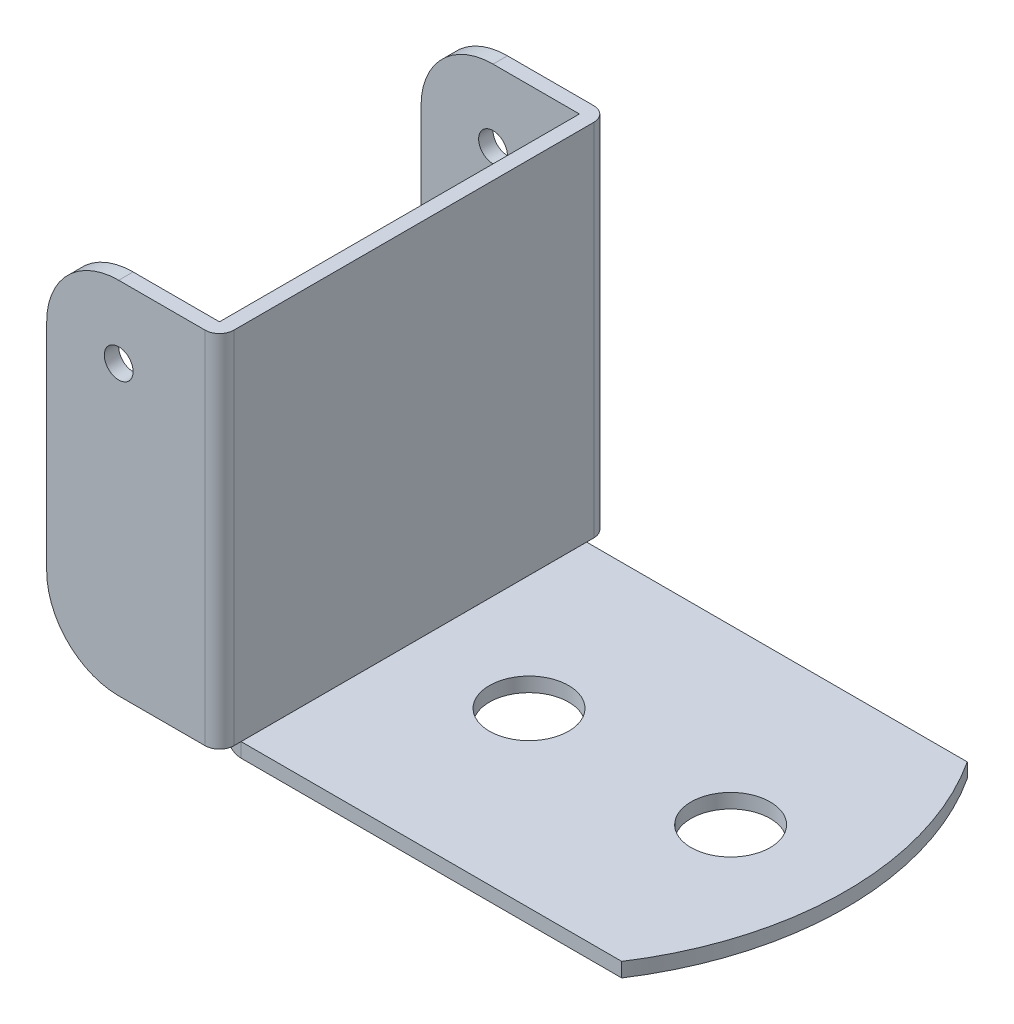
ISO-10303-21;
HEADER;
FILE_DESCRIPTION(('STEP AP214'),'2;1');
FILE_NAME('part.step','',(''),(''),'','','');
FILE_SCHEMA(('AUTOMOTIVE_DESIGN { 1 0 10303 214 1 1 1 1 }'));
ENDSEC;
DATA;
#1=APPLICATION_CONTEXT('core data for automotive mechanical design processes');
#2=APPLICATION_PROTOCOL_DEFINITION('international standard','automotive_design',2000,#1);
#3=PRODUCT_CONTEXT('',#1,'mechanical');
#4=PRODUCT('Part','Part','',(#3));
#5=PRODUCT_RELATED_PRODUCT_CATEGORY('part','',(#4));
#6=PRODUCT_DEFINITION_FORMATION('','',#4);
#7=PRODUCT_DEFINITION_CONTEXT('part definition',#1,'design');
#8=PRODUCT_DEFINITION('design','',#6,#7);
#9=PRODUCT_DEFINITION_SHAPE('','',#8);
#10=(LENGTH_UNIT() NAMED_UNIT(*) SI_UNIT(.MILLI.,.METRE.));
#11=(NAMED_UNIT(*) PLANE_ANGLE_UNIT() SI_UNIT($,.RADIAN.));
#12=(NAMED_UNIT(*) SI_UNIT($,.STERADIAN.) SOLID_ANGLE_UNIT());
#13=UNCERTAINTY_MEASURE_WITH_UNIT(LENGTH_MEASURE(1.E-05),#10,'distance_accuracy_value','');
#14=(GEOMETRIC_REPRESENTATION_CONTEXT(3) GLOBAL_UNCERTAINTY_ASSIGNED_CONTEXT((#13)) GLOBAL_UNIT_ASSIGNED_CONTEXT((#10,
#11,#12)) REPRESENTATION_CONTEXT('',''));
#15=CARTESIAN_POINT('',(0.,0.,0.));
#16=DIRECTION('',(0.,0.,1.));
#17=DIRECTION('',(1.,0.,0.));
#18=AXIS2_PLACEMENT_3D('',#15,#16,#17);
#19=CARTESIAN_POINT('',(0.000999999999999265,1.001,-24.));
#20=DIRECTION('',(0.,0.,1.));
#21=DIRECTION('',(1.,0.,0.));
#22=AXIS2_PLACEMENT_3D('',#19,#20,#21);
#23=PLANE('',#22);
#24=DIRECTION('',(-1.,0.,0.));
#25=VECTOR('',#24,1.);
#26=CARTESIAN_POINT('',(0.,1.00041349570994,-24.));
#27=LINE('',#26,#25);
#28=CARTESIAN_POINT('',(0.,1.00041349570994,-24.));
#29=VERTEX_POINT('',#28);
#30=CARTESIAN_POINT('',(-0.999999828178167,1.00041349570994,-24.));
#31=VERTEX_POINT('',#30);
#32=EDGE_CURVE('E707',#29,#31,#27,.T.);
#33=ORIENTED_EDGE('',*,*,#32,.F.);
#34=DIRECTION('',(0.,-1.,0.));
#35=VECTOR('',#34,1.);
#36=CARTESIAN_POINT('',(0.,26.0004134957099,-24.));
#37=LINE('',#36,#35);
#38=CARTESIAN_POINT('',(0.,1.001,-24.));
#39=VERTEX_POINT('',#38);
#40=EDGE_CURVE('E205',#39,#29,#37,.T.);
#41=ORIENTED_EDGE('',*,*,#40,.F.);
#42=CARTESIAN_POINT('',(0.000999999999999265,1.001,-24.));
#43=DIRECTION('',(0.,0.,-1.));
#44=DIRECTION('',(-1.,0.,0.));
#45=AXIS2_PLACEMENT_3D('',#42,#43,#44);
#46=CIRCLE('',#45,0.000999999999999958);
#47=CARTESIAN_POINT('',(0.000999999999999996,1.,-24.));
#48=VERTEX_POINT('',#47);
#49=EDGE_CURVE('E302',#48,#39,#46,.T.);
#50=ORIENTED_EDGE('',*,*,#49,.F.);
#51=DIRECTION('',(0.,-1.,0.));
#52=VECTOR('',#51,1.);
#53=CARTESIAN_POINT('',(0.000999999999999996,1.,-24.));
#54=LINE('',#53,#52);
#55=CARTESIAN_POINT('',(0.000999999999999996,0.,-24.));
#56=VERTEX_POINT('',#55);
#57=EDGE_CURVE('E309',#48,#56,#54,.T.);
#58=ORIENTED_EDGE('',*,*,#57,.T.);
#59=CARTESIAN_POINT('',(0.000999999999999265,1.001,-24.));
#60=DIRECTION('',(0.,0.,1.));
#61=DIRECTION('',(1.,0.,0.));
#62=AXIS2_PLACEMENT_3D('',#59,#60,#61);
#63=CIRCLE('',#62,1.001);
#64=EDGE_CURVE('E313',#56,#31,#63,.F.);
#65=ORIENTED_EDGE('',*,*,#64,.T.);
#66=EDGE_LOOP('',(#33,#41,#50,#58,#65));
#67=FACE_BOUND('',#66,.T.);
#68=ADVANCED_FACE('F48',(#67),#23,.F.);
#69=CARTESIAN_POINT('',(0.000999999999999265,1.001,0.));
#70=DIRECTION('',(0.,0.,-1.));
#71=DIRECTION('',(-1.,0.,0.));
#72=AXIS2_PLACEMENT_3D('',#69,#70,#71);
#73=PLANE('',#72);
#74=CARTESIAN_POINT('',(0.000999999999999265,1.001,0.));
#75=DIRECTION('',(0.,0.,1.));
#76=DIRECTION('',(1.,0.,0.));
#77=AXIS2_PLACEMENT_3D('',#74,#75,#76);
#78=CIRCLE('',#77,0.000999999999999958);
#79=CARTESIAN_POINT('',(0.,1.001,0.));
#80=VERTEX_POINT('',#79);
#81=CARTESIAN_POINT('',(0.000999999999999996,1.,0.));
#82=VERTEX_POINT('',#81);
#83=EDGE_CURVE('E305',#80,#82,#78,.T.);
#84=ORIENTED_EDGE('',*,*,#83,.F.);
#85=DIRECTION('',(0.,1.,0.));
#86=VECTOR('',#85,1.);
#87=CARTESIAN_POINT('',(0.,26.0004134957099,0.));
#88=LINE('',#87,#86);
#89=CARTESIAN_POINT('',(0.,1.00041349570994,0.));
#90=VERTEX_POINT('',#89);
#91=EDGE_CURVE('E294',#90,#80,#88,.T.);
#92=ORIENTED_EDGE('',*,*,#91,.F.);
#93=DIRECTION('',(1.,0.,0.));
#94=VECTOR('',#93,1.);
#95=CARTESIAN_POINT('',(0.,1.00041349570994,0.));
#96=LINE('',#95,#94);
#97=CARTESIAN_POINT('',(-0.99999999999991,1.00041349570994,0.));
#98=VERTEX_POINT('',#97);
#99=EDGE_CURVE('E285',#98,#90,#96,.T.);
#100=ORIENTED_EDGE('',*,*,#99,.F.);
#101=CARTESIAN_POINT('',(0.000999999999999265,1.001,0.));
#102=DIRECTION('',(0.,0.,1.));
#103=DIRECTION('',(1.,0.,0.));
#104=AXIS2_PLACEMENT_3D('',#101,#102,#103);
#105=CIRCLE('',#104,1.001);
#106=CARTESIAN_POINT('',(0.000999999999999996,0.,0.));
#107=VERTEX_POINT('',#106);
#108=EDGE_CURVE('E312',#98,#107,#105,.T.);
#109=ORIENTED_EDGE('',*,*,#108,.T.);
#110=DIRECTION('',(0.,1.,0.));
#111=VECTOR('',#110,1.);
#112=CARTESIAN_POINT('',(0.000999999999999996,1.,0.));
#113=LINE('',#112,#111);
#114=EDGE_CURVE('E349',#107,#82,#113,.T.);
#115=ORIENTED_EDGE('',*,*,#114,.T.);
#116=EDGE_LOOP('',(#84,#92,#100,#109,#115));
#117=FACE_BOUND('',#116,.T.);
#118=ADVANCED_FACE('F448',(#117),#73,.F.);
#119=CARTESIAN_POINT('',(-1.00000000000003,-6.99958650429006,-12.));
#120=DIRECTION('',(1.,0.,0.));
#121=DIRECTION('',(0.,0.,1.));
#122=AXIS2_PLACEMENT_3D('',#119,#120,#121);
#123=PLANE('',#122);
#124=DIRECTION('',(0.,0.,1.));
#125=VECTOR('',#124,1.);
#126=CARTESIAN_POINT('',(-0.999999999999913,26.0004134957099,0.));
#127=LINE('',#126,#125);
#128=CARTESIAN_POINT('',(-0.999999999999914,26.0004134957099,-24.5));
#129=VERTEX_POINT('',#128);
#130=CARTESIAN_POINT('',(-0.999999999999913,26.0004134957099,0.5));
#131=VERTEX_POINT('',#130);
#132=EDGE_CURVE('E276',#129,#131,#127,.T.);
#133=ORIENTED_EDGE('',*,*,#132,.F.);
#134=DIRECTION('',(0.,1.,0.));
#135=VECTOR('',#134,1.);
#136=CARTESIAN_POINT('',(-0.999999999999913,26.0004134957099,-24.5));
#137=LINE('',#136,#135);
#138=CARTESIAN_POINT('',(-0.999999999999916,1.00041349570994,-24.5));
#139=VERTEX_POINT('',#138);
#140=EDGE_CURVE('E240',#139,#129,#137,.T.);
#141=ORIENTED_EDGE('',*,*,#140,.F.);
#142=DIRECTION('',(0.,0.,1.));
#143=VECTOR('',#142,1.);
#144=CARTESIAN_POINT('',(-0.999999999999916,1.00041349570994,-24.5));
#145=LINE('',#144,#143);
#146=EDGE_CURVE('E244',#139,#31,#145,.T.);
#147=ORIENTED_EDGE('',*,*,#146,.T.);
#148=DIRECTION('',(0.,1.,0.));
#149=VECTOR('',#148,1.);
#150=CARTESIAN_POINT('',(-0.999999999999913,26.0004134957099,-24.));
#151=LINE('',#150,#149);
#152=CARTESIAN_POINT('',(-0.999999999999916,1.001,-24.));
#153=VERTEX_POINT('',#152);
#154=EDGE_CURVE('E245',#31,#153,#151,.T.);
#155=ORIENTED_EDGE('',*,*,#154,.T.);
#156=DIRECTION('',(0.,0.,1.));
#157=VECTOR('',#156,1.);
#158=CARTESIAN_POINT('',(-1.,1.001,-12.));
#159=LINE('',#158,#157);
#160=CARTESIAN_POINT('',(-1.,1.001,0.));
#161=VERTEX_POINT('',#160);
#162=EDGE_CURVE('E273',#153,#161,#159,.T.);
#163=ORIENTED_EDGE('',*,*,#162,.T.);
#164=EDGE_CURVE('E306',#161,#98,#105,.T.);
#165=ORIENTED_EDGE('',*,*,#164,.T.);
#166=DIRECTION('',(0.,0.,-1.));
#167=VECTOR('',#166,1.);
#168=CARTESIAN_POINT('',(-0.99999999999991,1.00041349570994,0.5));
#169=LINE('',#168,#167);
#170=CARTESIAN_POINT('',(-0.999999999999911,1.00041349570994,0.5));
#171=VERTEX_POINT('',#170);
#172=EDGE_CURVE('E301',#171,#98,#169,.T.);
#173=ORIENTED_EDGE('',*,*,#172,.F.);
#174=DIRECTION('',(0.,-1.,0.));
#175=VECTOR('',#174,1.);
#176=CARTESIAN_POINT('',(-0.999999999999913,26.0004134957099,0.5));
#177=LINE('',#176,#175);
#178=EDGE_CURVE('E280',#131,#171,#177,.T.);
#179=ORIENTED_EDGE('',*,*,#178,.F.);
#180=EDGE_LOOP('',(#133,#141,#147,#155,#163,#165,#173,#179));
#181=FACE_BOUND('',#180,.T.);
#182=ADVANCED_FACE('F369',(#181),#123,.F.);
#183=CARTESIAN_POINT('',(0.,-6.99958650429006,-12.));
#184=DIRECTION('',(1.,0.,0.));
#185=DIRECTION('',(0.,0.,1.));
#186=AXIS2_PLACEMENT_3D('',#183,#184,#185);
#187=PLANE('',#186);
#188=DIRECTION('',(0.,0.,1.));
#189=VECTOR('',#188,1.);
#190=CARTESIAN_POINT('',(0.,1.00041349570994,-24.5));
#191=LINE('',#190,#189);
#192=CARTESIAN_POINT('',(0.,1.00041349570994,-24.5));
#193=VERTEX_POINT('',#192);
#194=EDGE_CURVE('E250',#193,#29,#191,.T.);
#195=ORIENTED_EDGE('',*,*,#194,.F.);
#196=DIRECTION('',(0.,1.,0.));
#197=VECTOR('',#196,1.);
#198=CARTESIAN_POINT('',(0.,26.0004134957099,-24.5));
#199=LINE('',#198,#197);
#200=CARTESIAN_POINT('',(0.,26.0004134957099,-24.5));
#201=VERTEX_POINT('',#200);
#202=EDGE_CURVE('E253',#193,#201,#199,.T.);
#203=ORIENTED_EDGE('',*,*,#202,.T.);
#204=DIRECTION('',(0.,0.,1.));
#205=VECTOR('',#204,1.);
#206=CARTESIAN_POINT('',(0.,26.0004134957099,0.));
#207=LINE('',#206,#205);
#208=CARTESIAN_POINT('',(0.,26.0004134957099,0.5));
#209=VERTEX_POINT('',#208);
#210=EDGE_CURVE('E278',#201,#209,#207,.T.);
#211=ORIENTED_EDGE('',*,*,#210,.T.);
#212=DIRECTION('',(0.,1.,0.));
#213=VECTOR('',#212,1.);
#214=CARTESIAN_POINT('',(0.,1.00041349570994,0.5));
#215=LINE('',#214,#213);
#216=CARTESIAN_POINT('',(0.,1.00041349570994,0.5));
#217=VERTEX_POINT('',#216);
#218=EDGE_CURVE('E259',#209,#217,#215,.F.);
#219=ORIENTED_EDGE('',*,*,#218,.T.);
#220=DIRECTION('',(0.,0.,-1.));
#221=VECTOR('',#220,1.);
#222=CARTESIAN_POINT('',(0.,1.00041349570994,0.5));
#223=LINE('',#222,#221);
#224=EDGE_CURVE('E284',#217,#90,#223,.T.);
#225=ORIENTED_EDGE('',*,*,#224,.T.);
#226=ORIENTED_EDGE('',*,*,#91,.T.);
#227=DIRECTION('',(0.,0.,1.));
#228=VECTOR('',#227,1.);
#229=CARTESIAN_POINT('',(0.,1.001,-12.));
#230=LINE('',#229,#228);
#231=EDGE_CURVE('E358',#39,#80,#230,.T.);
#232=ORIENTED_EDGE('',*,*,#231,.F.);
#233=ORIENTED_EDGE('',*,*,#40,.T.);
#234=EDGE_LOOP('',(#195,#203,#211,#219,#225,#226,#232,#233));
#235=FACE_BOUND('',#234,.T.);
#236=ADVANCED_FACE('F490',(#235),#187,.T.);
#237=CARTESIAN_POINT('',(0.,26.0004134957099,0.));
#238=DIRECTION('',(0.,-1.,0.));
#239=DIRECTION('',(0.,0.,-1.));
#240=AXIS2_PLACEMENT_3D('',#237,#238,#239);
#241=PLANE('',#240);
#242=ORIENTED_EDGE('',*,*,#210,.F.);
#243=CARTESIAN_POINT('',(-0.999999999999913,26.0004134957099,-24.5));
#244=DIRECTION('',(0.,-1.,0.));
#245=DIRECTION('',(1.,0.,0.));
#246=AXIS2_PLACEMENT_3D('',#243,#244,#245);
#247=CIRCLE('',#246,1.);
#248=CARTESIAN_POINT('',(-0.999999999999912,26.0004134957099,-25.5));
#249=VERTEX_POINT('',#248);
#250=EDGE_CURVE('E70',#201,#249,#247,.F.);
#251=ORIENTED_EDGE('',*,*,#250,.T.);
#252=DIRECTION('',(-1.,0.,0.));
#253=VECTOR('',#252,1.);
#254=CARTESIAN_POINT('',(0.,26.0004134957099,-25.5));
#255=LINE('',#254,#253);
#256=CARTESIAN_POINT('',(-6.99999999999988,26.0004134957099,-25.5));
#257=VERTEX_POINT('',#256);
#258=EDGE_CURVE('E224',#249,#257,#255,.T.);
#259=ORIENTED_EDGE('',*,*,#258,.T.);
#260=DIRECTION('',(0.,0.,1.));
#261=VECTOR('',#260,1.);
#262=CARTESIAN_POINT('',(-6.99999999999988,26.0004134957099,-25.5));
#263=LINE('',#262,#261);
#264=CARTESIAN_POINT('',(-6.99999999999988,26.0004134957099,-24.5));
#265=VERTEX_POINT('',#264);
#266=EDGE_CURVE('E226',#257,#265,#263,.T.);
#267=ORIENTED_EDGE('',*,*,#266,.T.);
#268=DIRECTION('',(-1.,0.,0.));
#269=VECTOR('',#268,1.);
#270=CARTESIAN_POINT('',(0.,26.0004134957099,-24.5));
#271=LINE('',#270,#269);
#272=EDGE_CURVE('E213',#129,#265,#271,.T.);
#273=ORIENTED_EDGE('',*,*,#272,.F.);
#274=ORIENTED_EDGE('',*,*,#132,.T.);
#275=DIRECTION('',(-1.,0.,0.));
#276=VECTOR('',#275,1.);
#277=CARTESIAN_POINT('',(0.,26.0004134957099,0.5));
#278=LINE('',#277,#276);
#279=CARTESIAN_POINT('',(-6.99999999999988,26.0004134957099,0.5));
#280=VERTEX_POINT('',#279);
#281=EDGE_CURVE('E291',#131,#280,#278,.T.);
#282=ORIENTED_EDGE('',*,*,#281,.T.);
#283=DIRECTION('',(0.,0.,-1.));
#284=VECTOR('',#283,1.);
#285=CARTESIAN_POINT('',(-6.99999999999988,26.0004134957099,1.5));
#286=LINE('',#285,#284);
#287=CARTESIAN_POINT('',(-6.99999999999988,26.0004134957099,1.5));
#288=VERTEX_POINT('',#287);
#289=EDGE_CURVE('E297',#288,#280,#286,.T.);
#290=ORIENTED_EDGE('',*,*,#289,.F.);
#291=DIRECTION('',(-1.,0.,0.));
#292=VECTOR('',#291,1.);
#293=CARTESIAN_POINT('',(0.,26.0004134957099,1.5));
#294=LINE('',#293,#292);
#295=CARTESIAN_POINT('',(-0.999999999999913,26.0004134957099,1.5));
#296=VERTEX_POINT('',#295);
#297=EDGE_CURVE('E394',#296,#288,#294,.T.);
#298=ORIENTED_EDGE('',*,*,#297,.F.);
#299=CARTESIAN_POINT('',(-0.999999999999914,26.0004134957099,0.5));
#300=DIRECTION('',(0.,-1.,0.));
#301=DIRECTION('',(1.,0.,0.));
#302=AXIS2_PLACEMENT_3D('',#299,#300,#301);
#303=CIRCLE('',#302,1.);
#304=EDGE_CURVE('E265',#296,#209,#303,.F.);
#305=ORIENTED_EDGE('',*,*,#304,.T.);
#306=EDGE_LOOP('',(#242,#251,#259,#267,#273,#274,#282,#290,#298,#305));
#307=FACE_BOUND('',#306,.T.);
#308=ADVANCED_FACE('F431',(#307),#241,.F.);
#309=CARTESIAN_POINT('',(8.,1.,-12.));
#310=DIRECTION('',(0.,-1.,0.));
#311=DIRECTION('',(0.,0.,-1.));
#312=AXIS2_PLACEMENT_3D('',#309,#310,#311);
#313=CYLINDRICAL_SURFACE('',#312,22.);
#314=CARTESIAN_POINT('',(8.,0.,-12.));
#315=DIRECTION('',(0.,1.,0.));
#316=DIRECTION('',(0.,0.,1.));
#317=AXIS2_PLACEMENT_3D('',#314,#315,#316);
#318=CIRCLE('',#317,22.);
#319=CARTESIAN_POINT('',(26.4390889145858,0.,0.));
#320=VERTEX_POINT('',#319);
#321=CARTESIAN_POINT('',(26.4390889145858,0.,-24.));
#322=VERTEX_POINT('',#321);
#323=EDGE_CURVE('E346',#320,#322,#318,.T.);
#324=ORIENTED_EDGE('',*,*,#323,.T.);
#325=DIRECTION('',(0.,-1.,0.));
#326=VECTOR('',#325,1.);
#327=CARTESIAN_POINT('',(26.4390889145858,1.,-24.));
#328=LINE('',#327,#326);
#329=CARTESIAN_POINT('',(26.4390889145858,1.,-24.));
#330=VERTEX_POINT('',#329);
#331=EDGE_CURVE('E317',#330,#322,#328,.T.);
#332=ORIENTED_EDGE('',*,*,#331,.F.);
#333=CARTESIAN_POINT('',(8.,1.,-12.));
#334=DIRECTION('',(0.,1.,0.));
#335=DIRECTION('',(0.,0.,1.));
#336=AXIS2_PLACEMENT_3D('',#333,#334,#335);
#337=CIRCLE('',#336,22.);
#338=CARTESIAN_POINT('',(26.4390889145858,1.,0.));
#339=VERTEX_POINT('',#338);
#340=EDGE_CURVE('E328',#339,#330,#337,.T.);
#341=ORIENTED_EDGE('',*,*,#340,.F.);
#342=DIRECTION('',(0.,-1.,0.));
#343=VECTOR('',#342,1.);
#344=CARTESIAN_POINT('',(26.4390889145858,1.,0.));
#345=LINE('',#344,#343);
#346=EDGE_CURVE('E343',#339,#320,#345,.T.);
#347=ORIENTED_EDGE('',*,*,#346,.T.);
#348=EDGE_LOOP('',(#324,#332,#341,#347));
#349=FACE_BOUND('',#348,.T.);
#350=ADVANCED_FACE('F459',(#349),#313,.T.);
#351=CARTESIAN_POINT('',(8.,1.,-12.));
#352=DIRECTION('',(0.,-1.,0.));
#353=DIRECTION('',(0.,0.,-1.));
#354=AXIS2_PLACEMENT_3D('',#351,#352,#353);
#355=CYLINDRICAL_SURFACE('',#354,2.75);
#356=CARTESIAN_POINT('',(8.,1.,-12.));
#357=DIRECTION('',(0.,1.,0.));
#358=DIRECTION('',(0.,0.,1.));
#359=AXIS2_PLACEMENT_3D('',#356,#357,#358);
#360=CIRCLE('',#359,2.75);
#361=CARTESIAN_POINT('',(8.,1.,-9.25));
#362=VERTEX_POINT('',#361);
#363=EDGE_CURVE('E340',#362,#362,#360,.T.);
#364=ORIENTED_EDGE('',*,*,#363,.T.);
#365=EDGE_LOOP('',(#364));
#366=FACE_BOUND('',#365,.T.);
#367=CARTESIAN_POINT('',(8.,0.,-12.));
#368=DIRECTION('',(0.,1.,0.));
#369=DIRECTION('',(0.,0.,1.));
#370=AXIS2_PLACEMENT_3D('',#367,#368,#369);
#371=CIRCLE('',#370,2.75);
#372=CARTESIAN_POINT('',(8.,0.,-9.25));
#373=VERTEX_POINT('',#372);
#374=EDGE_CURVE('E323',#373,#373,#371,.T.);
#375=ORIENTED_EDGE('',*,*,#374,.F.);
#376=EDGE_LOOP('',(#375));
#377=FACE_BOUND('',#376,.T.);
#378=ADVANCED_FACE('F462',(#366,#377),#355,.F.);
#379=CARTESIAN_POINT('',(22.,1.,-12.));
#380=DIRECTION('',(0.,-1.,0.));
#381=DIRECTION('',(0.,0.,-1.));
#382=AXIS2_PLACEMENT_3D('',#379,#380,#381);
#383=CYLINDRICAL_SURFACE('',#382,2.74999999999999);
#384=CARTESIAN_POINT('',(22.,1.,-12.));
#385=DIRECTION('',(0.,1.,0.));
#386=DIRECTION('',(0.,0.,1.));
#387=AXIS2_PLACEMENT_3D('',#384,#385,#386);
#388=CIRCLE('',#387,2.74999999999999);
#389=CARTESIAN_POINT('',(22.,1.,-9.25000000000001));
#390=VERTEX_POINT('',#389);
#391=EDGE_CURVE('E337',#390,#390,#388,.T.);
#392=ORIENTED_EDGE('',*,*,#391,.T.);
#393=EDGE_LOOP('',(#392));
#394=FACE_BOUND('',#393,.T.);
#395=CARTESIAN_POINT('',(22.,0.,-12.));
#396=DIRECTION('',(0.,1.,0.));
#397=DIRECTION('',(0.,0.,1.));
#398=AXIS2_PLACEMENT_3D('',#395,#396,#397);
#399=CIRCLE('',#398,2.74999999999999);
#400=CARTESIAN_POINT('',(22.,0.,-9.25000000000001));
#401=VERTEX_POINT('',#400);
#402=EDGE_CURVE('E320',#401,#401,#399,.T.);
#403=ORIENTED_EDGE('',*,*,#402,.F.);
#404=EDGE_LOOP('',(#403));
#405=FACE_BOUND('',#404,.T.);
#406=ADVANCED_FACE('F466',(#394,#405),#383,.F.);
#407=CARTESIAN_POINT('',(8.,1.,-12.));
#408=DIRECTION('',(0.,1.,0.));
#409=DIRECTION('',(0.,0.,1.));
#410=AXIS2_PLACEMENT_3D('',#407,#408,#409);
#411=PLANE('',#410);
#412=ORIENTED_EDGE('',*,*,#391,.F.);
#413=EDGE_LOOP('',(#412));
#414=FACE_BOUND('',#413,.T.);
#415=ORIENTED_EDGE('',*,*,#363,.F.);
#416=EDGE_LOOP('',(#415));
#417=FACE_BOUND('',#416,.T.);
#418=DIRECTION('',(-1.,0.,0.));
#419=VECTOR('',#418,1.);
#420=CARTESIAN_POINT('',(0.,1.,-24.));
#421=LINE('',#420,#419);
#422=EDGE_CURVE('E335',#330,#48,#421,.T.);
#423=ORIENTED_EDGE('',*,*,#422,.T.);
#424=DIRECTION('',(0.,0.,1.));
#425=VECTOR('',#424,1.);
#426=CARTESIAN_POINT('',(0.000999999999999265,1.,-12.));
#427=LINE('',#426,#425);
#428=EDGE_CURVE('E332',#48,#82,#427,.T.);
#429=ORIENTED_EDGE('',*,*,#428,.T.);
#430=DIRECTION('',(1.,0.,0.));
#431=VECTOR('',#430,1.);
#432=CARTESIAN_POINT('',(0.,1.,0.));
#433=LINE('',#432,#431);
#434=EDGE_CURVE('E330',#82,#339,#433,.T.);
#435=ORIENTED_EDGE('',*,*,#434,.T.);
#436=ORIENTED_EDGE('',*,*,#340,.T.);
#437=EDGE_LOOP('',(#423,#429,#435,#436));
#438=FACE_BOUND('',#437,.T.);
#439=ADVANCED_FACE('F470',(#414,#417,#438),#411,.T.);
#440=CARTESIAN_POINT('',(0.,1.,0.));
#441=DIRECTION('',(0.,0.,-1.));
#442=DIRECTION('',(-1.,0.,0.));
#443=AXIS2_PLACEMENT_3D('',#440,#441,#442);
#444=PLANE('',#443);
#445=ORIENTED_EDGE('',*,*,#114,.F.);
#446=DIRECTION('',(1.,0.,0.));
#447=VECTOR('',#446,1.);
#448=CARTESIAN_POINT('',(0.,0.,0.));
#449=LINE('',#448,#447);
#450=EDGE_CURVE('E326',#107,#320,#449,.T.);
#451=ORIENTED_EDGE('',*,*,#450,.T.);
#452=ORIENTED_EDGE('',*,*,#346,.F.);
#453=ORIENTED_EDGE('',*,*,#434,.F.);
#454=EDGE_LOOP('',(#445,#451,#452,#453));
#455=FACE_BOUND('',#454,.T.);
#456=ADVANCED_FACE('F474',(#455),#444,.F.);
#457=CARTESIAN_POINT('',(8.,0.,-12.));
#458=DIRECTION('',(0.,1.,0.));
#459=DIRECTION('',(0.,0.,1.));
#460=AXIS2_PLACEMENT_3D('',#457,#458,#459);
#461=PLANE('',#460);
#462=DIRECTION('',(0.,0.,1.));
#463=VECTOR('',#462,1.);
#464=CARTESIAN_POINT('',(0.000999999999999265,0.,-12.));
#465=LINE('',#464,#463);
#466=EDGE_CURVE('E352',#56,#107,#465,.T.);
#467=ORIENTED_EDGE('',*,*,#466,.F.);
#468=DIRECTION('',(-1.,0.,0.));
#469=VECTOR('',#468,1.);
#470=CARTESIAN_POINT('',(0.,0.,-24.));
#471=LINE('',#470,#469);
#472=EDGE_CURVE('E279',#322,#56,#471,.T.);
#473=ORIENTED_EDGE('',*,*,#472,.F.);
#474=ORIENTED_EDGE('',*,*,#323,.F.);
#475=ORIENTED_EDGE('',*,*,#450,.F.);
#476=EDGE_LOOP('',(#467,#473,#474,#475));
#477=FACE_BOUND('',#476,.T.);
#478=ORIENTED_EDGE('',*,*,#374,.T.);
#479=EDGE_LOOP('',(#478));
#480=FACE_BOUND('',#479,.T.);
#481=ORIENTED_EDGE('',*,*,#402,.T.);
#482=EDGE_LOOP('',(#481));
#483=FACE_BOUND('',#482,.T.);
#484=ADVANCED_FACE('F478',(#477,#480,#483),#461,.F.);
#485=CARTESIAN_POINT('',(0.,1.,-24.));
#486=DIRECTION('',(0.,0.,1.));
#487=DIRECTION('',(1.,0.,0.));
#488=AXIS2_PLACEMENT_3D('',#485,#486,#487);
#489=PLANE('',#488);
#490=ORIENTED_EDGE('',*,*,#57,.F.);
#491=ORIENTED_EDGE('',*,*,#422,.F.);
#492=ORIENTED_EDGE('',*,*,#331,.T.);
#493=ORIENTED_EDGE('',*,*,#472,.T.);
#494=EDGE_LOOP('',(#490,#491,#492,#493));
#495=FACE_BOUND('',#494,.T.);
#496=ADVANCED_FACE('F482',(#495),#489,.F.);
#497=CARTESIAN_POINT('',(0.000999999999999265,1.001,-36.0208243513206));
#498=DIRECTION('',(0.,0.,1.));
#499=DIRECTION('',(1.,0.,0.));
#500=AXIS2_PLACEMENT_3D('',#497,#498,#499);
#501=CYLINDRICAL_SURFACE('',#500,0.001);
#502=ORIENTED_EDGE('',*,*,#83,.T.);
#503=ORIENTED_EDGE('',*,*,#428,.F.);
#504=ORIENTED_EDGE('',*,*,#49,.T.);
#505=ORIENTED_EDGE('',*,*,#231,.T.);
#506=EDGE_LOOP('',(#502,#503,#504,#505));
#507=FACE_BOUND('',#506,.T.);
#508=ADVANCED_FACE('F486',(#507),#501,.F.);
#509=CARTESIAN_POINT('',(0.000999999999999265,1.001,-36.0208243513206));
#510=DIRECTION('',(0.,0.,1.));
#511=DIRECTION('',(1.,0.,0.));
#512=AXIS2_PLACEMENT_3D('',#509,#510,#511);
#513=CYLINDRICAL_SURFACE('',#512,1.001);
#514=ORIENTED_EDGE('',*,*,#164,.F.);
#515=ORIENTED_EDGE('',*,*,#162,.F.);
#516=ORIENTED_EDGE('',*,*,#154,.F.);
#517=ORIENTED_EDGE('',*,*,#64,.F.);
#518=ORIENTED_EDGE('',*,*,#466,.T.);
#519=ORIENTED_EDGE('',*,*,#108,.F.);
#520=EDGE_LOOP('',(#514,#515,#516,#517,#518,#519));
#521=FACE_BOUND('',#520,.T.);
#522=ADVANCED_FACE('F541',(#521),#513,.T.);
#523=CARTESIAN_POINT('',(0.,1.00041349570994,0.5));
#524=DIRECTION('',(0.,1.,0.));
#525=DIRECTION('',(-1.,0.,0.));
#526=AXIS2_PLACEMENT_3D('',#523,#524,#525);
#527=PLANE('',#526);
#528=ORIENTED_EDGE('',*,*,#224,.F.);
#529=CARTESIAN_POINT('',(-1.,1.00041349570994,0.5));
#530=DIRECTION('',(0.,1.,0.));
#531=DIRECTION('',(-1.,0.,0.));
#532=AXIS2_PLACEMENT_3D('',#529,#530,#531);
#533=CIRCLE('',#532,1.);
#534=CARTESIAN_POINT('',(-1.,1.00041349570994,1.5));
#535=VERTEX_POINT('',#534);
#536=EDGE_CURVE('E246',#217,#535,#533,.F.);
#537=ORIENTED_EDGE('',*,*,#536,.T.);
#538=DIRECTION('',(1.,0.,0.));
#539=VECTOR('',#538,1.);
#540=CARTESIAN_POINT('',(0.,1.00041349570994,1.5));
#541=LINE('',#540,#539);
#542=CARTESIAN_POINT('',(-6.99999999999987,1.00041349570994,1.5));
#543=VERTEX_POINT('',#542);
#544=EDGE_CURVE('E402',#543,#535,#541,.T.);
#545=ORIENTED_EDGE('',*,*,#544,.F.);
#546=DIRECTION('',(0.,0.,-1.));
#547=VECTOR('',#546,1.);
#548=CARTESIAN_POINT('',(-6.99999999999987,1.00041349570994,1.5));
#549=LINE('',#548,#547);
#550=CARTESIAN_POINT('',(-6.99999999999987,1.00041349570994,0.5));
#551=VERTEX_POINT('',#550);
#552=EDGE_CURVE('E403',#543,#551,#549,.T.);
#553=ORIENTED_EDGE('',*,*,#552,.T.);
#554=DIRECTION('',(1.,0.,0.));
#555=VECTOR('',#554,1.);
#556=CARTESIAN_POINT('',(0.,1.00041349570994,0.5));
#557=LINE('',#556,#555);
#558=EDGE_CURVE('E366',#551,#171,#557,.T.);
#559=ORIENTED_EDGE('',*,*,#558,.T.);
#560=ORIENTED_EDGE('',*,*,#172,.T.);
#561=ORIENTED_EDGE('',*,*,#99,.T.);
#562=EDGE_LOOP('',(#528,#537,#545,#553,#559,#560,#561));
#563=FACE_BOUND('',#562,.T.);
#564=ADVANCED_FACE('F362',(#563),#527,.F.);
#565=CARTESIAN_POINT('',(-6.99999999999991,6.00041349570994,1.5));
#566=DIRECTION('',(0.,0.,-1.));
#567=DIRECTION('',(-1.,0.,0.));
#568=AXIS2_PLACEMENT_3D('',#565,#566,#567);
#569=PLANE('',#568);
#570=ORIENTED_EDGE('',*,*,#544,.T.);
#571=DIRECTION('',(0.,1.,0.));
#572=VECTOR('',#571,1.);
#573=CARTESIAN_POINT('',(-0.999999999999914,26.0004134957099,1.5));
#574=LINE('',#573,#572);
#575=EDGE_CURVE('E268',#535,#296,#574,.T.);
#576=ORIENTED_EDGE('',*,*,#575,.T.);
#577=ORIENTED_EDGE('',*,*,#297,.T.);
#578=CARTESIAN_POINT('',(-6.99999999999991,21.0004134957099,1.5));
#579=DIRECTION('',(0.,0.,1.));
#580=DIRECTION('',(-1.,0.,0.));
#581=AXIS2_PLACEMENT_3D('',#578,#579,#580);
#582=CIRCLE('',#581,5.);
#583=CARTESIAN_POINT('',(-11.9999999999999,21.0004134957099,1.5));
#584=VERTEX_POINT('',#583);
#585=EDGE_CURVE('E396',#288,#584,#582,.T.);
#586=ORIENTED_EDGE('',*,*,#585,.T.);
#587=DIRECTION('',(0.,-1.,0.));
#588=VECTOR('',#587,1.);
#589=CARTESIAN_POINT('',(-11.9999999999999,21.0004134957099,1.5));
#590=LINE('',#589,#588);
#591=CARTESIAN_POINT('',(-11.9999999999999,6.00041349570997,1.5));
#592=VERTEX_POINT('',#591);
#593=EDGE_CURVE('E398',#584,#592,#590,.T.);
#594=ORIENTED_EDGE('',*,*,#593,.T.);
#595=CARTESIAN_POINT('',(-6.99999999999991,6.00041349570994,1.5));
#596=DIRECTION('',(0.,0.,1.));
#597=DIRECTION('',(-1.,0.,0.));
#598=AXIS2_PLACEMENT_3D('',#595,#596,#597);
#599=CIRCLE('',#598,5.);
#600=EDGE_CURVE('E400',#592,#543,#599,.T.);
#601=ORIENTED_EDGE('',*,*,#600,.T.);
#602=EDGE_LOOP('',(#570,#576,#577,#586,#594,#601));
#603=FACE_BOUND('',#602,.T.);
#604=CARTESIAN_POINT('',(-6.99999999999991,21.0004134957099,1.5));
#605=DIRECTION('',(0.,0.,1.));
#606=DIRECTION('',(1.,0.,0.));
#607=AXIS2_PLACEMENT_3D('',#604,#605,#606);
#608=CIRCLE('',#607,1.);
#609=CARTESIAN_POINT('',(-5.99999999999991,21.0004134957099,1.5));
#610=VERTEX_POINT('',#609);
#611=EDGE_CURVE('E381',#610,#610,#608,.T.);
#612=ORIENTED_EDGE('',*,*,#611,.F.);
#613=EDGE_LOOP('',(#612));
#614=FACE_BOUND('',#613,.T.);
#615=ADVANCED_FACE('F433',(#603,#614),#569,.F.);
#616=CARTESIAN_POINT('',(-6.99999999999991,6.00041349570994,0.5));
#617=DIRECTION('',(0.,0.,-1.));
#618=DIRECTION('',(-1.,0.,0.));
#619=AXIS2_PLACEMENT_3D('',#616,#617,#618);
#620=PLANE('',#619);
#621=ORIENTED_EDGE('',*,*,#281,.F.);
#622=ORIENTED_EDGE('',*,*,#178,.T.);
#623=ORIENTED_EDGE('',*,*,#558,.F.);
#624=CARTESIAN_POINT('',(-6.99999999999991,6.00041349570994,0.5));
#625=DIRECTION('',(0.,0.,1.));
#626=DIRECTION('',(-1.,0.,0.));
#627=AXIS2_PLACEMENT_3D('',#624,#625,#626);
#628=CIRCLE('',#627,5.);
#629=CARTESIAN_POINT('',(-11.9999999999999,6.00041349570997,0.5));
#630=VERTEX_POINT('',#629);
#631=EDGE_CURVE('E407',#630,#551,#628,.T.);
#632=ORIENTED_EDGE('',*,*,#631,.F.);
#633=DIRECTION('',(0.,-1.,0.));
#634=VECTOR('',#633,1.);
#635=CARTESIAN_POINT('',(-11.9999999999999,21.0004134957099,0.5));
#636=LINE('',#635,#634);
#637=CARTESIAN_POINT('',(-11.9999999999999,21.0004134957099,0.5));
#638=VERTEX_POINT('',#637);
#639=EDGE_CURVE('E382',#638,#630,#636,.T.);
#640=ORIENTED_EDGE('',*,*,#639,.F.);
#641=CARTESIAN_POINT('',(-6.99999999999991,21.0004134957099,0.5));
#642=DIRECTION('',(0.,0.,1.));
#643=DIRECTION('',(-1.,0.,0.));
#644=AXIS2_PLACEMENT_3D('',#641,#642,#643);
#645=CIRCLE('',#644,5.);
#646=EDGE_CURVE('E378',#280,#638,#645,.T.);
#647=ORIENTED_EDGE('',*,*,#646,.F.);
#648=EDGE_LOOP('',(#621,#622,#623,#632,#640,#647));
#649=FACE_BOUND('',#648,.T.);
#650=CARTESIAN_POINT('',(-6.99999999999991,21.0004134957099,0.5));
#651=DIRECTION('',(0.,0.,1.));
#652=DIRECTION('',(1.,0.,0.));
#653=AXIS2_PLACEMENT_3D('',#650,#651,#652);
#654=CIRCLE('',#653,1.);
#655=CARTESIAN_POINT('',(-5.99999999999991,21.0004134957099,0.5));
#656=VERTEX_POINT('',#655);
#657=EDGE_CURVE('E385',#656,#656,#654,.T.);
#658=ORIENTED_EDGE('',*,*,#657,.T.);
#659=EDGE_LOOP('',(#658));
#660=FACE_BOUND('',#659,.T.);
#661=ADVANCED_FACE('F373',(#649,#660),#620,.T.);
#662=CARTESIAN_POINT('',(-6.99999999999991,21.0004134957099,1.5));
#663=DIRECTION('',(0.,0.,-1.));
#664=DIRECTION('',(-1.,0.,0.));
#665=AXIS2_PLACEMENT_3D('',#662,#663,#664);
#666=CYLINDRICAL_SURFACE('',#665,5.);
#667=ORIENTED_EDGE('',*,*,#646,.T.);
#668=DIRECTION('',(0.,0.,-1.));
#669=VECTOR('',#668,1.);
#670=CARTESIAN_POINT('',(-11.9999999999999,21.0004134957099,1.5));
#671=LINE('',#670,#669);
#672=EDGE_CURVE('E414',#584,#638,#671,.T.);
#673=ORIENTED_EDGE('',*,*,#672,.F.);
#674=ORIENTED_EDGE('',*,*,#585,.F.);
#675=ORIENTED_EDGE('',*,*,#289,.T.);
#676=EDGE_LOOP('',(#667,#673,#674,#675));
#677=FACE_BOUND('',#676,.T.);
#678=ADVANCED_FACE('F429',(#677),#666,.T.);
#679=CARTESIAN_POINT('',(-11.9999999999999,21.0004134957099,1.5));
#680=DIRECTION('',(1.,0.,0.));
#681=DIRECTION('',(0.,1.,0.));
#682=AXIS2_PLACEMENT_3D('',#679,#680,#681);
#683=PLANE('',#682);
#684=ORIENTED_EDGE('',*,*,#639,.T.);
#685=DIRECTION('',(0.,0.,-1.));
#686=VECTOR('',#685,1.);
#687=CARTESIAN_POINT('',(-11.9999999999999,6.00041349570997,1.5));
#688=LINE('',#687,#686);
#689=EDGE_CURVE('E416',#592,#630,#688,.T.);
#690=ORIENTED_EDGE('',*,*,#689,.F.);
#691=ORIENTED_EDGE('',*,*,#593,.F.);
#692=ORIENTED_EDGE('',*,*,#672,.T.);
#693=EDGE_LOOP('',(#684,#690,#691,#692));
#694=FACE_BOUND('',#693,.T.);
#695=ADVANCED_FACE('F424',(#694),#683,.F.);
#696=CARTESIAN_POINT('',(-6.99999999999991,6.00041349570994,1.5));
#697=DIRECTION('',(0.,0.,-1.));
#698=DIRECTION('',(-1.,0.,0.));
#699=AXIS2_PLACEMENT_3D('',#696,#697,#698);
#700=CYLINDRICAL_SURFACE('',#699,5.);
#701=ORIENTED_EDGE('',*,*,#631,.T.);
#702=ORIENTED_EDGE('',*,*,#552,.F.);
#703=ORIENTED_EDGE('',*,*,#600,.F.);
#704=ORIENTED_EDGE('',*,*,#689,.T.);
#705=EDGE_LOOP('',(#701,#702,#703,#704));
#706=FACE_BOUND('',#705,.T.);
#707=ADVANCED_FACE('F422',(#706),#700,.T.);
#708=CARTESIAN_POINT('',(-6.99999999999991,21.0004134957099,1.5));
#709=DIRECTION('',(0.,0.,-1.));
#710=DIRECTION('',(-1.,0.,0.));
#711=AXIS2_PLACEMENT_3D('',#708,#709,#710);
#712=CYLINDRICAL_SURFACE('',#711,1.);
#713=ORIENTED_EDGE('',*,*,#611,.T.);
#714=EDGE_LOOP('',(#713));
#715=FACE_BOUND('',#714,.T.);
#716=ORIENTED_EDGE('',*,*,#657,.F.);
#717=EDGE_LOOP('',(#716));
#718=FACE_BOUND('',#717,.T.);
#719=ADVANCED_FACE('F439',(#715,#718),#712,.F.);
#720=CARTESIAN_POINT('',(-0.999999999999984,6.00041349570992,0.5));
#721=DIRECTION('',(0.,-1.,0.));
#722=DIRECTION('',(1.,0.,0.));
#723=AXIS2_PLACEMENT_3D('',#720,#721,#722);
#724=CYLINDRICAL_SURFACE('',#723,1.);
#725=ORIENTED_EDGE('',*,*,#536,.F.);
#726=ORIENTED_EDGE('',*,*,#218,.F.);
#727=ORIENTED_EDGE('',*,*,#304,.F.);
#728=ORIENTED_EDGE('',*,*,#575,.F.);
#729=EDGE_LOOP('',(#725,#726,#727,#728));
#730=FACE_BOUND('',#729,.T.);
#731=ADVANCED_FACE('F437',(#730),#724,.T.);
#732=CARTESIAN_POINT('',(0.,1.00041349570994,-24.5));
#733=DIRECTION('',(0.,1.,0.));
#734=DIRECTION('',(0.,0.,1.));
#735=AXIS2_PLACEMENT_3D('',#732,#733,#734);
#736=PLANE('',#735);
#737=DIRECTION('',(1.,0.,0.));
#738=VECTOR('',#737,1.);
#739=CARTESIAN_POINT('',(0.,1.00041349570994,-25.5));
#740=LINE('',#739,#738);
#741=CARTESIAN_POINT('',(-6.99999999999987,1.00041349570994,-25.5));
#742=VERTEX_POINT('',#741);
#743=CARTESIAN_POINT('',(-1.,1.00041349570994,-25.5));
#744=VERTEX_POINT('',#743);
#745=EDGE_CURVE('E197',#742,#744,#740,.T.);
#746=ORIENTED_EDGE('',*,*,#745,.T.);
#747=CARTESIAN_POINT('',(-1.,1.00041349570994,-24.5));
#748=DIRECTION('',(0.,1.,0.));
#749=DIRECTION('',(0.,0.,1.));
#750=AXIS2_PLACEMENT_3D('',#747,#748,#749);
#751=CIRCLE('',#750,1.);
#752=EDGE_CURVE('E14',#744,#193,#751,.F.);
#753=ORIENTED_EDGE('',*,*,#752,.T.);
#754=ORIENTED_EDGE('',*,*,#194,.T.);
#755=ORIENTED_EDGE('',*,*,#32,.T.);
#756=ORIENTED_EDGE('',*,*,#146,.F.);
#757=DIRECTION('',(1.,0.,0.));
#758=VECTOR('',#757,1.);
#759=CARTESIAN_POINT('',(0.,1.00041349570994,-24.5));
#760=LINE('',#759,#758);
#761=CARTESIAN_POINT('',(-6.99999999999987,1.00041349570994,-24.5));
#762=VERTEX_POINT('',#761);
#763=EDGE_CURVE('E200',#762,#139,#760,.T.);
#764=ORIENTED_EDGE('',*,*,#763,.F.);
#765=DIRECTION('',(0.,0.,1.));
#766=VECTOR('',#765,1.);
#767=CARTESIAN_POINT('',(-6.99999999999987,1.00041349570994,-25.5));
#768=LINE('',#767,#766);
#769=EDGE_CURVE('E195',#742,#762,#768,.T.);
#770=ORIENTED_EDGE('',*,*,#769,.F.);
#771=EDGE_LOOP('',(#746,#753,#754,#755,#756,#764,#770));
#772=FACE_BOUND('',#771,.T.);
#773=ADVANCED_FACE('F196',(#772),#736,.F.);
#774=CARTESIAN_POINT('',(-6.99999999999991,6.00041349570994,-25.5));
#775=DIRECTION('',(0.,0.,1.));
#776=DIRECTION('',(1.,0.,0.));
#777=AXIS2_PLACEMENT_3D('',#774,#775,#776);
#778=CYLINDRICAL_SURFACE('',#777,5.);
#779=CARTESIAN_POINT('',(-6.99999999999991,6.00041349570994,-24.5));
#780=DIRECTION('',(0.,0.,1.));
#781=DIRECTION('',(-1.,0.,0.));
#782=AXIS2_PLACEMENT_3D('',#779,#780,#781);
#783=CIRCLE('',#782,5.);
#784=CARTESIAN_POINT('',(-11.9999999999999,6.00041349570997,-24.5));
#785=VERTEX_POINT('',#784);
#786=EDGE_CURVE('E229',#785,#762,#783,.T.);
#787=ORIENTED_EDGE('',*,*,#786,.F.);
#788=DIRECTION('',(0.,0.,1.));
#789=VECTOR('',#788,1.);
#790=CARTESIAN_POINT('',(-11.9999999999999,6.00041349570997,-25.5));
#791=LINE('',#790,#789);
#792=CARTESIAN_POINT('',(-11.9999999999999,6.00041349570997,-25.5));
#793=VERTEX_POINT('',#792);
#794=EDGE_CURVE('E206',#793,#785,#791,.T.);
#795=ORIENTED_EDGE('',*,*,#794,.F.);
#796=CARTESIAN_POINT('',(-6.99999999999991,6.00041349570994,-25.5));
#797=DIRECTION('',(0.,0.,1.));
#798=DIRECTION('',(-1.,0.,0.));
#799=AXIS2_PLACEMENT_3D('',#796,#797,#798);
#800=CIRCLE('',#799,5.);
#801=EDGE_CURVE('E211',#793,#742,#800,.T.);
#802=ORIENTED_EDGE('',*,*,#801,.T.);
#803=ORIENTED_EDGE('',*,*,#769,.T.);
#804=EDGE_LOOP('',(#787,#795,#802,#803));
#805=FACE_BOUND('',#804,.T.);
#806=ADVANCED_FACE('F215',(#805),#778,.T.);
#807=CARTESIAN_POINT('',(-11.9999999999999,21.0004134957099,-25.5));
#808=DIRECTION('',(-1.,0.,0.));
#809=DIRECTION('',(0.,-1.,0.));
#810=AXIS2_PLACEMENT_3D('',#807,#808,#809);
#811=PLANE('',#810);
#812=DIRECTION('',(0.,-1.,0.));
#813=VECTOR('',#812,1.);
#814=CARTESIAN_POINT('',(-11.9999999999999,21.0004134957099,-24.5));
#815=LINE('',#814,#813);
#816=CARTESIAN_POINT('',(-11.9999999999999,21.0004134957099,-24.5));
#817=VERTEX_POINT('',#816);
#818=EDGE_CURVE('E735',#817,#785,#815,.T.);
#819=ORIENTED_EDGE('',*,*,#818,.F.);
#820=DIRECTION('',(0.,0.,1.));
#821=VECTOR('',#820,1.);
#822=CARTESIAN_POINT('',(-11.9999999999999,21.0004134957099,-25.5));
#823=LINE('',#822,#821);
#824=CARTESIAN_POINT('',(-11.9999999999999,21.0004134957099,-25.5));
#825=VERTEX_POINT('',#824);
#826=EDGE_CURVE('E742',#825,#817,#823,.T.);
#827=ORIENTED_EDGE('',*,*,#826,.F.);
#828=DIRECTION('',(0.,-1.,0.));
#829=VECTOR('',#828,1.);
#830=CARTESIAN_POINT('',(-11.9999999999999,21.0004134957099,-25.5));
#831=LINE('',#830,#829);
#832=EDGE_CURVE('E216',#825,#793,#831,.T.);
#833=ORIENTED_EDGE('',*,*,#832,.T.);
#834=ORIENTED_EDGE('',*,*,#794,.T.);
#835=EDGE_LOOP('',(#819,#827,#833,#834));
#836=FACE_BOUND('',#835,.T.);
#837=ADVANCED_FACE('F643',(#836),#811,.T.);
#838=CARTESIAN_POINT('',(-6.99999999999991,21.0004134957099,-25.5));
#839=DIRECTION('',(0.,0.,1.));
#840=DIRECTION('',(1.,0.,0.));
#841=AXIS2_PLACEMENT_3D('',#838,#839,#840);
#842=CYLINDRICAL_SURFACE('',#841,5.);
#843=CARTESIAN_POINT('',(-6.99999999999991,21.0004134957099,-24.5));
#844=DIRECTION('',(0.,0.,1.));
#845=DIRECTION('',(-1.,0.,0.));
#846=AXIS2_PLACEMENT_3D('',#843,#844,#845);
#847=CIRCLE('',#846,5.);
#848=EDGE_CURVE('E736',#265,#817,#847,.T.);
#849=ORIENTED_EDGE('',*,*,#848,.F.);
#850=ORIENTED_EDGE('',*,*,#266,.F.);
#851=CARTESIAN_POINT('',(-6.99999999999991,21.0004134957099,-25.5));
#852=DIRECTION('',(0.,0.,1.));
#853=DIRECTION('',(-1.,0.,0.));
#854=AXIS2_PLACEMENT_3D('',#851,#852,#853);
#855=CIRCLE('',#854,5.);
#856=EDGE_CURVE('E218',#257,#825,#855,.T.);
#857=ORIENTED_EDGE('',*,*,#856,.T.);
#858=ORIENTED_EDGE('',*,*,#826,.T.);
#859=EDGE_LOOP('',(#849,#850,#857,#858));
#860=FACE_BOUND('',#859,.T.);
#861=ADVANCED_FACE('F651',(#860),#842,.T.);
#862=CARTESIAN_POINT('',(-6.99999999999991,6.00041349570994,-25.5));
#863=DIRECTION('',(0.,0.,1.));
#864=DIRECTION('',(-1.,0.,0.));
#865=AXIS2_PLACEMENT_3D('',#862,#863,#864);
#866=PLANE('',#865);
#867=CARTESIAN_POINT('',(-6.99999999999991,21.0004134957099,-25.5));
#868=DIRECTION('',(0.,0.,1.));
#869=DIRECTION('',(1.,0.,0.));
#870=AXIS2_PLACEMENT_3D('',#867,#868,#869);
#871=CIRCLE('',#870,1.);
#872=CARTESIAN_POINT('',(-5.99999999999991,21.0004134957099,-25.5));
#873=VERTEX_POINT('',#872);
#874=EDGE_CURVE('E234',#873,#873,#871,.T.);
#875=ORIENTED_EDGE('',*,*,#874,.T.);
#876=EDGE_LOOP('',(#875));
#877=FACE_BOUND('',#876,.T.);
#878=ORIENTED_EDGE('',*,*,#258,.F.);
#879=DIRECTION('',(0.,1.,0.));
#880=VECTOR('',#879,1.);
#881=CARTESIAN_POINT('',(-1.,1.00041349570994,-25.5));
#882=LINE('',#881,#880);
#883=EDGE_CURVE('E56',#249,#744,#882,.F.);
#884=ORIENTED_EDGE('',*,*,#883,.T.);
#885=ORIENTED_EDGE('',*,*,#745,.F.);
#886=ORIENTED_EDGE('',*,*,#801,.F.);
#887=ORIENTED_EDGE('',*,*,#832,.F.);
#888=ORIENTED_EDGE('',*,*,#856,.F.);
#889=EDGE_LOOP('',(#878,#884,#885,#886,#887,#888));
#890=FACE_BOUND('',#889,.T.);
#891=ADVANCED_FACE('F209',(#877,#890),#866,.F.);
#892=CARTESIAN_POINT('',(-6.99999999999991,6.00041349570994,-24.5));
#893=DIRECTION('',(0.,0.,1.));
#894=DIRECTION('',(-1.,0.,0.));
#895=AXIS2_PLACEMENT_3D('',#892,#893,#894);
#896=PLANE('',#895);
#897=CARTESIAN_POINT('',(-6.99999999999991,21.0004134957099,-24.5));
#898=DIRECTION('',(0.,0.,1.));
#899=DIRECTION('',(1.,0.,0.));
#900=AXIS2_PLACEMENT_3D('',#897,#898,#899);
#901=CIRCLE('',#900,1.);
#902=CARTESIAN_POINT('',(-5.99999999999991,21.0004134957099,-24.5));
#903=VERTEX_POINT('',#902);
#904=EDGE_CURVE('E752',#903,#903,#901,.T.);
#905=ORIENTED_EDGE('',*,*,#904,.F.);
#906=EDGE_LOOP('',(#905));
#907=FACE_BOUND('',#906,.T.);
#908=ORIENTED_EDGE('',*,*,#763,.T.);
#909=ORIENTED_EDGE('',*,*,#140,.T.);
#910=ORIENTED_EDGE('',*,*,#272,.T.);
#911=ORIENTED_EDGE('',*,*,#848,.T.);
#912=ORIENTED_EDGE('',*,*,#818,.T.);
#913=ORIENTED_EDGE('',*,*,#786,.T.);
#914=EDGE_LOOP('',(#908,#909,#910,#911,#912,#913));
#915=FACE_BOUND('',#914,.T.);
#916=ADVANCED_FACE('F668',(#907,#915),#896,.T.);
#917=CARTESIAN_POINT('',(-6.99999999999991,21.0004134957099,-25.5));
#918=DIRECTION('',(0.,0.,1.));
#919=DIRECTION('',(1.,0.,0.));
#920=AXIS2_PLACEMENT_3D('',#917,#918,#919);
#921=CYLINDRICAL_SURFACE('',#920,1.);
#922=ORIENTED_EDGE('',*,*,#874,.F.);
#923=EDGE_LOOP('',(#922));
#924=FACE_BOUND('',#923,.T.);
#925=ORIENTED_EDGE('',*,*,#904,.T.);
#926=EDGE_LOOP('',(#925));
#927=FACE_BOUND('',#926,.T.);
#928=ADVANCED_FACE('F677',(#924,#927),#921,.F.);
#929=CARTESIAN_POINT('',(-1.00000000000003,-6.99958650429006,-24.5));
#930=DIRECTION('',(0.,-1.,0.));
#931=DIRECTION('',(1.,0.,0.));
#932=AXIS2_PLACEMENT_3D('',#929,#930,#931);
#933=CYLINDRICAL_SURFACE('',#932,1.);
#934=ORIENTED_EDGE('',*,*,#752,.F.);
#935=ORIENTED_EDGE('',*,*,#883,.F.);
#936=ORIENTED_EDGE('',*,*,#250,.F.);
#937=ORIENTED_EDGE('',*,*,#202,.F.);
#938=EDGE_LOOP('',(#934,#935,#936,#937));
#939=FACE_BOUND('',#938,.T.);
#940=ADVANCED_FACE('F50',(#939),#933,.T.);
#941=CLOSED_SHELL('',(#68,#118,#182,#236,#308,#350,#378,#406,#439,#456,#484,#496,#508,#522,#564,
#615,#661,#678,#695,#707,#719,#731,#773,#806,#837,#861,#891,#916,#928,#940));
#942=MANIFOLD_SOLID_BREP('B2',#941);
#943=ADVANCED_BREP_SHAPE_REPRESENTATION('',(#18,#942),#14);
#944=SHAPE_DEFINITION_REPRESENTATION(#9,#943);
ENDSEC;
END-ISO-10303-21;
